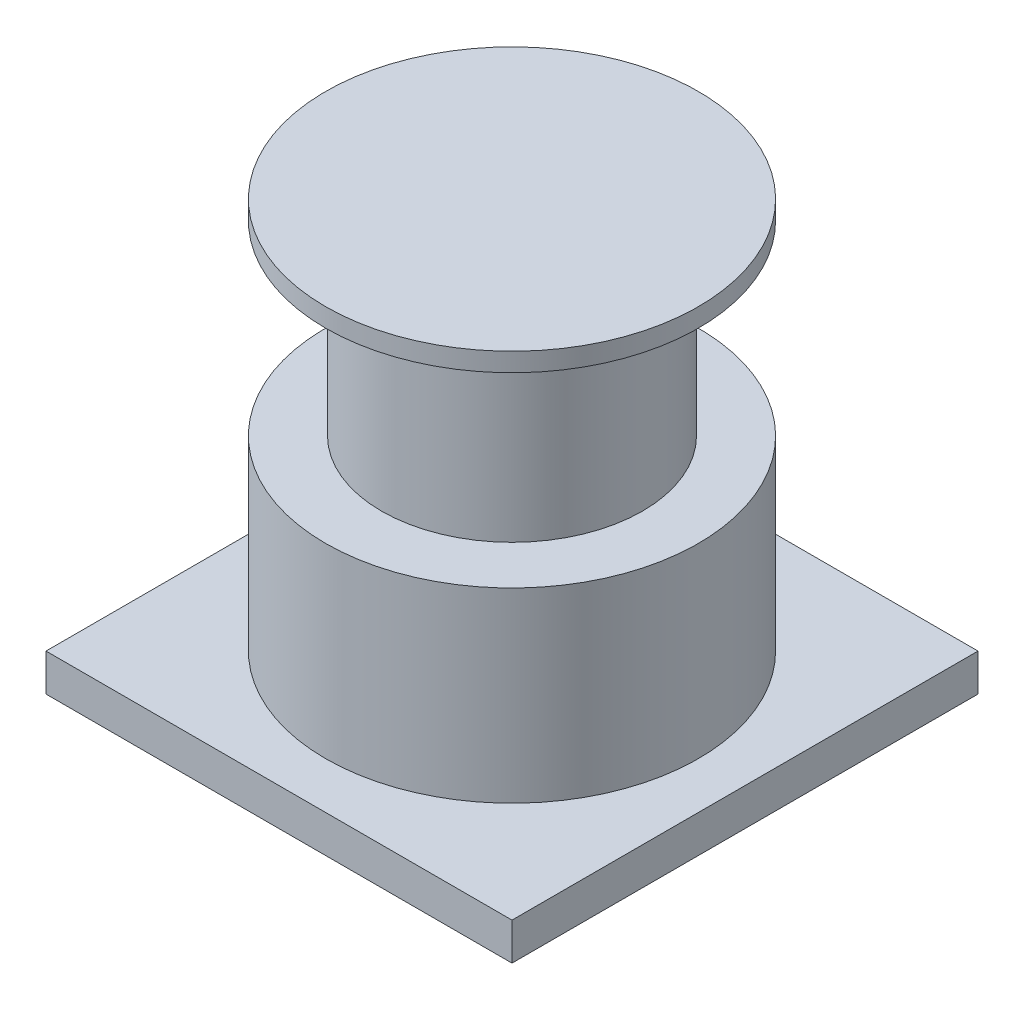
ISO-10303-21;
HEADER;
FILE_DESCRIPTION(('STEP AP214'),'2;1');
FILE_NAME('part.step','',(''),(''),'','','');
FILE_SCHEMA(('AUTOMOTIVE_DESIGN { 1 0 10303 214 1 1 1 1 }'));
ENDSEC;
DATA;
#1=APPLICATION_CONTEXT('core data for automotive mechanical design processes');
#2=APPLICATION_PROTOCOL_DEFINITION('international standard','automotive_design',2000,#1);
#3=PRODUCT_CONTEXT('',#1,'mechanical');
#4=PRODUCT('Part','Part','',(#3));
#5=PRODUCT_RELATED_PRODUCT_CATEGORY('part','',(#4));
#6=PRODUCT_DEFINITION_FORMATION('','',#4);
#7=PRODUCT_DEFINITION_CONTEXT('part definition',#1,'design');
#8=PRODUCT_DEFINITION('design','',#6,#7);
#9=PRODUCT_DEFINITION_SHAPE('','',#8);
#10=(LENGTH_UNIT() NAMED_UNIT(*) SI_UNIT(.MILLI.,.METRE.));
#11=(NAMED_UNIT(*) PLANE_ANGLE_UNIT() SI_UNIT($,.RADIAN.));
#12=(NAMED_UNIT(*) SI_UNIT($,.STERADIAN.) SOLID_ANGLE_UNIT());
#13=UNCERTAINTY_MEASURE_WITH_UNIT(LENGTH_MEASURE(1.E-05),#10,'distance_accuracy_value','');
#14=(GEOMETRIC_REPRESENTATION_CONTEXT(3) GLOBAL_UNCERTAINTY_ASSIGNED_CONTEXT((#13)) GLOBAL_UNIT_ASSIGNED_CONTEXT((#10,
#11,#12)) REPRESENTATION_CONTEXT('',''));
#15=CARTESIAN_POINT('',(0.,0.,0.));
#16=DIRECTION('',(0.,0.,1.));
#17=DIRECTION('',(1.,0.,0.));
#18=AXIS2_PLACEMENT_3D('',#15,#16,#17);
#19=CARTESIAN_POINT('',(-78.1893004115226,20.,163.168724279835));
#20=DIRECTION('',(1.,0.,0.));
#21=DIRECTION('',(0.,0.,-1.));
#22=AXIS2_PLACEMENT_3D('',#19,#20,#21);
#23=PLANE('',#22);
#24=DIRECTION('',(0.,0.,1.));
#25=VECTOR('',#24,1.);
#26=CARTESIAN_POINT('',(-78.1893004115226,0.,163.168724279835));
#27=LINE('',#26,#25);
#28=CARTESIAN_POINT('',(-78.1893004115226,0.,-86.8312757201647));
#29=VERTEX_POINT('',#28);
#30=CARTESIAN_POINT('',(-78.1893004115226,0.,163.168724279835));
#31=VERTEX_POINT('',#30);
#32=EDGE_CURVE('E106',#29,#31,#27,.T.);
#33=ORIENTED_EDGE('',*,*,#32,.T.);
#34=DIRECTION('',(0.,-1.,0.));
#35=VECTOR('',#34,1.);
#36=CARTESIAN_POINT('',(-78.1893004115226,20.,163.168724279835));
#37=LINE('',#36,#35);
#38=CARTESIAN_POINT('',(-78.1893004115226,20.,163.168724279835));
#39=VERTEX_POINT('',#38);
#40=EDGE_CURVE('E42',#39,#31,#37,.T.);
#41=ORIENTED_EDGE('',*,*,#40,.F.);
#42=DIRECTION('',(0.,0.,1.));
#43=VECTOR('',#42,1.);
#44=CARTESIAN_POINT('',(-78.1893004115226,20.,163.168724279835));
#45=LINE('',#44,#43);
#46=CARTESIAN_POINT('',(-78.1893004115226,20.,-86.8312757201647));
#47=VERTEX_POINT('',#46);
#48=EDGE_CURVE('E93',#47,#39,#45,.T.);
#49=ORIENTED_EDGE('',*,*,#48,.F.);
#50=DIRECTION('',(0.,-1.,0.));
#51=VECTOR('',#50,1.);
#52=CARTESIAN_POINT('',(-78.1893004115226,20.,-86.8312757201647));
#53=LINE('',#52,#51);
#54=EDGE_CURVE('E102',#47,#29,#53,.T.);
#55=ORIENTED_EDGE('',*,*,#54,.T.);
#56=EDGE_LOOP('',(#33,#41,#49,#55));
#57=FACE_BOUND('',#56,.T.);
#58=ADVANCED_FACE('F39',(#57),#23,.F.);
#59=CARTESIAN_POINT('',(-78.1893004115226,20.,163.168724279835));
#60=DIRECTION('',(0.,0.,-1.));
#61=DIRECTION('',(-1.,0.,0.));
#62=AXIS2_PLACEMENT_3D('',#59,#60,#61);
#63=PLANE('',#62);
#64=DIRECTION('',(1.,0.,0.));
#65=VECTOR('',#64,1.);
#66=CARTESIAN_POINT('',(-78.1893004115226,0.,163.168724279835));
#67=LINE('',#66,#65);
#68=CARTESIAN_POINT('',(171.810699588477,0.,163.168724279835));
#69=VERTEX_POINT('',#68);
#70=EDGE_CURVE('E98',#31,#69,#67,.T.);
#71=ORIENTED_EDGE('',*,*,#70,.T.);
#72=DIRECTION('',(0.,-1.,0.));
#73=VECTOR('',#72,1.);
#74=CARTESIAN_POINT('',(171.810699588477,20.,163.168724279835));
#75=LINE('',#74,#73);
#76=CARTESIAN_POINT('',(171.810699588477,20.,163.168724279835));
#77=VERTEX_POINT('',#76);
#78=EDGE_CURVE('E96',#77,#69,#75,.T.);
#79=ORIENTED_EDGE('',*,*,#78,.F.);
#80=DIRECTION('',(1.,0.,0.));
#81=VECTOR('',#80,1.);
#82=CARTESIAN_POINT('',(-78.1893004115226,20.,163.168724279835));
#83=LINE('',#82,#81);
#84=EDGE_CURVE('E88',#39,#77,#83,.T.);
#85=ORIENTED_EDGE('',*,*,#84,.F.);
#86=ORIENTED_EDGE('',*,*,#40,.T.);
#87=EDGE_LOOP('',(#71,#79,#85,#86));
#88=FACE_BOUND('',#87,.T.);
#89=ADVANCED_FACE('F97',(#88),#63,.F.);
#90=CARTESIAN_POINT('',(171.810699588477,20.,163.168724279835));
#91=DIRECTION('',(-1.,0.,0.));
#92=DIRECTION('',(0.,0.,1.));
#93=AXIS2_PLACEMENT_3D('',#90,#91,#92);
#94=PLANE('',#93);
#95=DIRECTION('',(0.,0.,-1.));
#96=VECTOR('',#95,1.);
#97=CARTESIAN_POINT('',(171.810699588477,0.,163.168724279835));
#98=LINE('',#97,#96);
#99=CARTESIAN_POINT('',(171.810699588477,0.,-86.8312757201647));
#100=VERTEX_POINT('',#99);
#101=EDGE_CURVE('E74',#69,#100,#98,.T.);
#102=ORIENTED_EDGE('',*,*,#101,.T.);
#103=DIRECTION('',(0.,-1.,0.));
#104=VECTOR('',#103,1.);
#105=CARTESIAN_POINT('',(171.810699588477,20.,-86.8312757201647));
#106=LINE('',#105,#104);
#107=CARTESIAN_POINT('',(171.810699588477,20.,-86.8312757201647));
#108=VERTEX_POINT('',#107);
#109=EDGE_CURVE('E99',#108,#100,#106,.T.);
#110=ORIENTED_EDGE('',*,*,#109,.F.);
#111=DIRECTION('',(0.,0.,-1.));
#112=VECTOR('',#111,1.);
#113=CARTESIAN_POINT('',(171.810699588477,20.,163.168724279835));
#114=LINE('',#113,#112);
#115=EDGE_CURVE('E91',#77,#108,#114,.T.);
#116=ORIENTED_EDGE('',*,*,#115,.F.);
#117=ORIENTED_EDGE('',*,*,#78,.T.);
#118=EDGE_LOOP('',(#102,#110,#116,#117));
#119=FACE_BOUND('',#118,.T.);
#120=ADVANCED_FACE('F100',(#119),#94,.F.);
#121=CARTESIAN_POINT('',(-78.1893004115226,20.,-86.8312757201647));
#122=DIRECTION('',(0.,0.,1.));
#123=DIRECTION('',(1.,0.,0.));
#124=AXIS2_PLACEMENT_3D('',#121,#122,#123);
#125=PLANE('',#124);
#126=DIRECTION('',(-1.,0.,0.));
#127=VECTOR('',#126,1.);
#128=CARTESIAN_POINT('',(-78.1893004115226,0.,-86.8312757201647));
#129=LINE('',#128,#127);
#130=EDGE_CURVE('E80',#100,#29,#129,.T.);
#131=ORIENTED_EDGE('',*,*,#130,.T.);
#132=ORIENTED_EDGE('',*,*,#54,.F.);
#133=DIRECTION('',(-1.,0.,0.));
#134=VECTOR('',#133,1.);
#135=CARTESIAN_POINT('',(-78.1893004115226,20.,-86.8312757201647));
#136=LINE('',#135,#134);
#137=EDGE_CURVE('E57',#108,#47,#136,.T.);
#138=ORIENTED_EDGE('',*,*,#137,.F.);
#139=ORIENTED_EDGE('',*,*,#109,.T.);
#140=EDGE_LOOP('',(#131,#132,#138,#139));
#141=FACE_BOUND('',#140,.T.);
#142=ADVANCED_FACE('F114',(#141),#125,.F.);
#143=CARTESIAN_POINT('',(0.,20.,0.));
#144=DIRECTION('',(0.,-1.,0.));
#145=DIRECTION('',(0.,0.,-1.));
#146=AXIS2_PLACEMENT_3D('',#143,#144,#145);
#147=PLANE('',#146);
#148=CARTESIAN_POINT('',(46.8106995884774,20.,38.1687242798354));
#149=DIRECTION('',(0.,1.,0.));
#150=DIRECTION('',(0.,0.,1.));
#151=AXIS2_PLACEMENT_3D('',#148,#149,#150);
#152=CIRCLE('',#151,100.);
#153=CARTESIAN_POINT('',(46.8106995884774,20.,138.168724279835));
#154=VERTEX_POINT('',#153);
#155=EDGE_CURVE('E48',#154,#154,#152,.T.);
#156=ORIENTED_EDGE('',*,*,#155,.F.);
#157=EDGE_LOOP('',(#156));
#158=FACE_BOUND('',#157,.T.);
#159=ORIENTED_EDGE('',*,*,#48,.T.);
#160=ORIENTED_EDGE('',*,*,#84,.T.);
#161=ORIENTED_EDGE('',*,*,#115,.T.);
#162=ORIENTED_EDGE('',*,*,#137,.T.);
#163=EDGE_LOOP('',(#159,#160,#161,#162));
#164=FACE_BOUND('',#163,.T.);
#165=ADVANCED_FACE('F89',(#158,#164),#147,.F.);
#166=CARTESIAN_POINT('',(0.,0.,0.));
#167=DIRECTION('',(0.,-1.,0.));
#168=DIRECTION('',(0.,0.,-1.));
#169=AXIS2_PLACEMENT_3D('',#166,#167,#168);
#170=PLANE('',#169);
#171=ORIENTED_EDGE('',*,*,#32,.F.);
#172=ORIENTED_EDGE('',*,*,#130,.F.);
#173=ORIENTED_EDGE('',*,*,#101,.F.);
#174=ORIENTED_EDGE('',*,*,#70,.F.);
#175=EDGE_LOOP('',(#171,#172,#173,#174));
#176=FACE_BOUND('',#175,.T.);
#177=ADVANCED_FACE('F117',(#176),#170,.T.);
#178=CARTESIAN_POINT('',(46.8106995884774,120.,38.1687242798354));
#179=DIRECTION('',(0.,-1.,0.));
#180=DIRECTION('',(0.,0.,-1.));
#181=AXIS2_PLACEMENT_3D('',#178,#179,#180);
#182=CYLINDRICAL_SURFACE('',#181,100.);
#183=CARTESIAN_POINT('',(46.8106995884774,120.,38.1687242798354));
#184=DIRECTION('',(0.,1.,0.));
#185=DIRECTION('',(0.,0.,1.));
#186=AXIS2_PLACEMENT_3D('',#183,#184,#185);
#187=CIRCLE('',#186,100.);
#188=CARTESIAN_POINT('',(46.8106995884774,120.,138.168724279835));
#189=VERTEX_POINT('',#188);
#190=EDGE_CURVE('E109',#189,#189,#187,.T.);
#191=ORIENTED_EDGE('',*,*,#190,.F.);
#192=EDGE_LOOP('',(#191));
#193=FACE_BOUND('',#192,.T.);
#194=ORIENTED_EDGE('',*,*,#155,.T.);
#195=EDGE_LOOP('',(#194));
#196=FACE_BOUND('',#195,.T.);
#197=ADVANCED_FACE('F164',(#193,#196),#182,.T.);
#198=CARTESIAN_POINT('',(46.8106995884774,120.,38.1687242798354));
#199=DIRECTION('',(0.,1.,0.));
#200=DIRECTION('',(0.,0.,1.));
#201=AXIS2_PLACEMENT_3D('',#198,#199,#200);
#202=PLANE('',#201);
#203=CARTESIAN_POINT('',(46.8106995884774,120.,38.1687242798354));
#204=DIRECTION('',(0.,1.,0.));
#205=DIRECTION('',(0.,0.,1.));
#206=AXIS2_PLACEMENT_3D('',#203,#204,#205);
#207=CIRCLE('',#206,70.);
#208=CARTESIAN_POINT('',(46.8106995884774,120.,108.168724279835));
#209=VERTEX_POINT('',#208);
#210=EDGE_CURVE('E11',#209,#209,#207,.T.);
#211=ORIENTED_EDGE('',*,*,#210,.F.);
#212=EDGE_LOOP('',(#211));
#213=FACE_BOUND('',#212,.T.);
#214=ORIENTED_EDGE('',*,*,#190,.T.);
#215=EDGE_LOOP('',(#214));
#216=FACE_BOUND('',#215,.T.);
#217=ADVANCED_FACE('F170',(#213,#216),#202,.T.);
#218=CARTESIAN_POINT('',(46.8106995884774,220.,38.1687242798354));
#219=DIRECTION('',(0.,-1.,0.));
#220=DIRECTION('',(0.,0.,-1.));
#221=AXIS2_PLACEMENT_3D('',#218,#219,#220);
#222=CYLINDRICAL_SURFACE('',#221,70.);
#223=CARTESIAN_POINT('',(46.8106995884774,220.,38.1687242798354));
#224=DIRECTION('',(0.,1.,0.));
#225=DIRECTION('',(0.,0.,1.));
#226=AXIS2_PLACEMENT_3D('',#223,#224,#225);
#227=CIRCLE('',#226,70.);
#228=CARTESIAN_POINT('',(46.8106995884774,220.,108.168724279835));
#229=VERTEX_POINT('',#228);
#230=EDGE_CURVE('E123',#229,#229,#227,.T.);
#231=ORIENTED_EDGE('',*,*,#230,.F.);
#232=EDGE_LOOP('',(#231));
#233=FACE_BOUND('',#232,.T.);
#234=ORIENTED_EDGE('',*,*,#210,.T.);
#235=EDGE_LOOP('',(#234));
#236=FACE_BOUND('',#235,.T.);
#237=ADVANCED_FACE('F139',(#233,#236),#222,.T.);
#238=CARTESIAN_POINT('',(46.8106995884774,230.,38.1687242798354));
#239=DIRECTION('',(0.,-1.,0.));
#240=DIRECTION('',(0.,0.,-1.));
#241=AXIS2_PLACEMENT_3D('',#238,#239,#240);
#242=CYLINDRICAL_SURFACE('',#241,100.);
#243=CARTESIAN_POINT('',(46.8106995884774,230.,38.1687242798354));
#244=DIRECTION('',(0.,1.,0.));
#245=DIRECTION('',(0.,0.,1.));
#246=AXIS2_PLACEMENT_3D('',#243,#244,#245);
#247=CIRCLE('',#246,100.);
#248=CARTESIAN_POINT('',(46.8106995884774,230.,138.168724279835));
#249=VERTEX_POINT('',#248);
#250=EDGE_CURVE('E127',#249,#249,#247,.T.);
#251=ORIENTED_EDGE('',*,*,#250,.F.);
#252=EDGE_LOOP('',(#251));
#253=FACE_BOUND('',#252,.T.);
#254=CARTESIAN_POINT('',(46.8106995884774,220.,38.1687242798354));
#255=DIRECTION('',(0.,1.,0.));
#256=DIRECTION('',(0.,0.,1.));
#257=AXIS2_PLACEMENT_3D('',#254,#255,#256);
#258=CIRCLE('',#257,100.);
#259=CARTESIAN_POINT('',(46.8106995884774,220.,138.168724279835));
#260=VERTEX_POINT('',#259);
#261=EDGE_CURVE('E128',#260,#260,#258,.T.);
#262=ORIENTED_EDGE('',*,*,#261,.T.);
#263=EDGE_LOOP('',(#262));
#264=FACE_BOUND('',#263,.T.);
#265=ADVANCED_FACE('F136',(#253,#264),#242,.T.);
#266=CARTESIAN_POINT('',(46.8106995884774,230.,38.1687242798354));
#267=DIRECTION('',(0.,1.,0.));
#268=DIRECTION('',(0.,0.,1.));
#269=AXIS2_PLACEMENT_3D('',#266,#267,#268);
#270=PLANE('',#269);
#271=ORIENTED_EDGE('',*,*,#250,.T.);
#272=EDGE_LOOP('',(#271));
#273=FACE_BOUND('',#272,.T.);
#274=ADVANCED_FACE('F134',(#273),#270,.T.);
#275=CARTESIAN_POINT('',(46.8106995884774,220.,38.1687242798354));
#276=DIRECTION('',(0.,1.,0.));
#277=DIRECTION('',(0.,0.,1.));
#278=AXIS2_PLACEMENT_3D('',#275,#276,#277);
#279=PLANE('',#278);
#280=ORIENTED_EDGE('',*,*,#230,.T.);
#281=EDGE_LOOP('',(#280));
#282=FACE_BOUND('',#281,.T.);
#283=ORIENTED_EDGE('',*,*,#261,.F.);
#284=EDGE_LOOP('',(#283));
#285=FACE_BOUND('',#284,.T.);
#286=ADVANCED_FACE('F143',(#282,#285),#279,.F.);
#287=CLOSED_SHELL('',(#58,#89,#120,#142,#165,#177,#197,#217,#237,#265,#274,#286));
#288=MANIFOLD_SOLID_BREP('B2',#287);
#289=ADVANCED_BREP_SHAPE_REPRESENTATION('',(#18,#288),#14);
#290=SHAPE_DEFINITION_REPRESENTATION(#9,#289);
ENDSEC;
END-ISO-10303-21;
